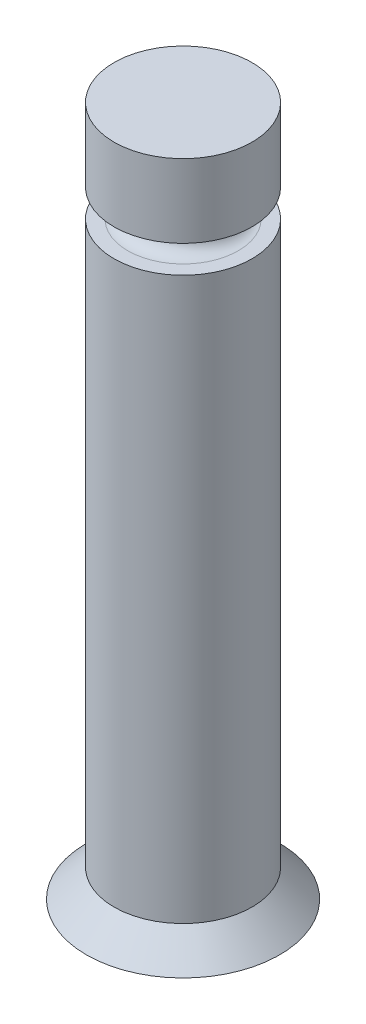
from build123d import *


with BuildPart() as part:
    # Sketch1 → Revolve1 (revolve)
    with BuildSketch(Plane.XY, mode=Mode.PRIVATE) as revolve1_sk:
        with BuildLine():
            Line((0, 0), (-5, 0))
            Line((-5, 0), (-5, -5.316319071))
            Line((-5, -5.316319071), (-4, -5.316319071))
            ThreePointArc((-4, -5.316319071), (-3, -6.316319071), (-4, -7.316319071))
            Line((-4, -7.316319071), (-5, -7.316319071))
            Line((-5, -7.316319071), (-5, -48))
            Line((-5, -48), (-7, -50))
            Line((-7, -50), (0, -50))
            Line((0, -50), (0, 0))
        make_face()
    revolve(revolve1_sk.sketch.rotate(Axis((0, 0, 0), (0, -1, 0)), 270), axis=Axis((0, 0, 0), (0, -1, 0)))


solid = part.part
